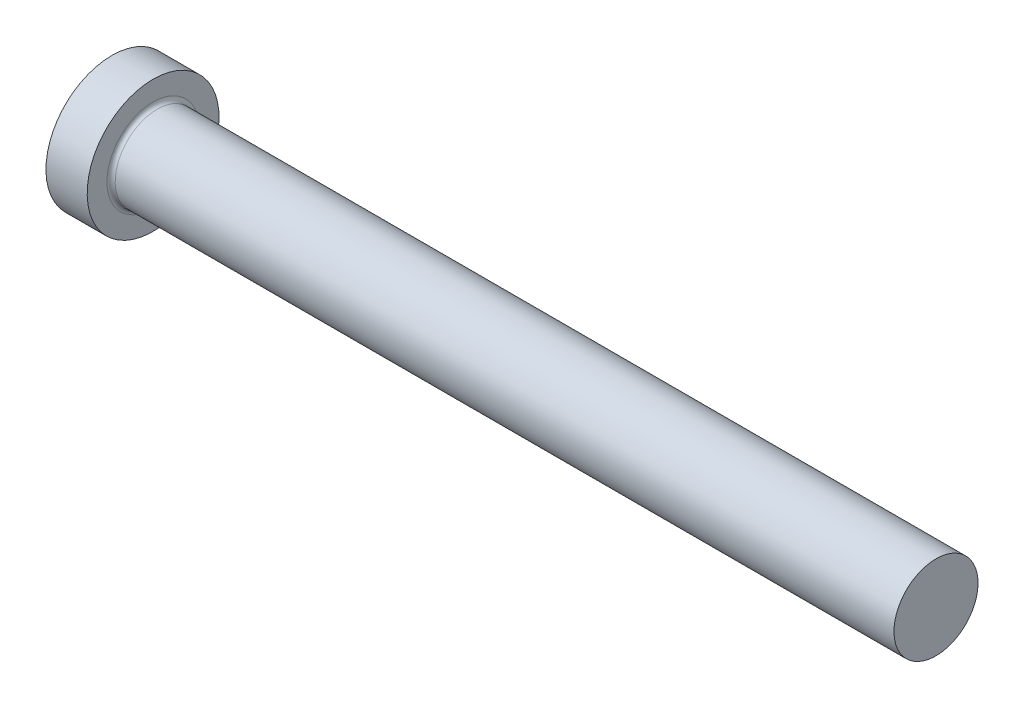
ISO-10303-21;
HEADER;
FILE_DESCRIPTION(('STEP AP214'),'2;1');
FILE_NAME('part.step','',(''),(''),'','','');
FILE_SCHEMA(('AUTOMOTIVE_DESIGN { 1 0 10303 214 1 1 1 1 }'));
ENDSEC;
DATA;
#1=APPLICATION_CONTEXT('core data for automotive mechanical design processes');
#2=APPLICATION_PROTOCOL_DEFINITION('international standard','automotive_design',2000,#1);
#3=PRODUCT_CONTEXT('',#1,'mechanical');
#4=PRODUCT('Part','Part','',(#3));
#5=PRODUCT_RELATED_PRODUCT_CATEGORY('part','',(#4));
#6=PRODUCT_DEFINITION_FORMATION('','',#4);
#7=PRODUCT_DEFINITION_CONTEXT('part definition',#1,'design');
#8=PRODUCT_DEFINITION('design','',#6,#7);
#9=PRODUCT_DEFINITION_SHAPE('','',#8);
#10=(LENGTH_UNIT() NAMED_UNIT(*) SI_UNIT(.MILLI.,.METRE.));
#11=(NAMED_UNIT(*) PLANE_ANGLE_UNIT() SI_UNIT($,.RADIAN.));
#12=(NAMED_UNIT(*) SI_UNIT($,.STERADIAN.) SOLID_ANGLE_UNIT());
#13=UNCERTAINTY_MEASURE_WITH_UNIT(LENGTH_MEASURE(1.E-05),#10,'distance_accuracy_value','');
#14=(GEOMETRIC_REPRESENTATION_CONTEXT(3) GLOBAL_UNCERTAINTY_ASSIGNED_CONTEXT((#13)) GLOBAL_UNIT_ASSIGNED_CONTEXT((#10,
#11,#12)) REPRESENTATION_CONTEXT('',''));
#15=CARTESIAN_POINT('',(0.,0.,0.));
#16=DIRECTION('',(0.,0.,1.));
#17=DIRECTION('',(1.,0.,0.));
#18=AXIS2_PLACEMENT_3D('',#15,#16,#17);
#19=CARTESIAN_POINT('',(0.,0.,0.));
#20=DIRECTION('',(-1.,0.,0.));
#21=DIRECTION('',(0.,-1.,0.));
#22=AXIS2_PLACEMENT_3D('',#19,#20,#21);
#23=PLANE('',#22);
#24=CARTESIAN_POINT('',(0.,0.,0.));
#25=DIRECTION('',(1.,0.,0.));
#26=DIRECTION('',(0.,1.,0.));
#27=AXIS2_PLACEMENT_3D('',#24,#25,#26);
#28=CIRCLE('',#27,8.);
#29=CARTESIAN_POINT('',(0.,8.,0.));
#30=VERTEX_POINT('',#29);
#31=EDGE_CURVE('E24',#30,#30,#28,.T.);
#32=ORIENTED_EDGE('',*,*,#31,.F.);
#33=EDGE_LOOP('',(#32));
#34=FACE_BOUND('',#33,.T.);
#35=ADVANCED_FACE('F13',(#34),#23,.T.);
#36=CARTESIAN_POINT('',(100.,0.,0.));
#37=DIRECTION('',(1.,0.,0.));
#38=DIRECTION('',(0.,1.,0.));
#39=AXIS2_PLACEMENT_3D('',#36,#37,#38);
#40=CYLINDRICAL_SURFACE('',#39,8.);
#41=ORIENTED_EDGE('',*,*,#31,.T.);
#42=EDGE_LOOP('',(#41));
#43=FACE_BOUND('',#42,.T.);
#44=CARTESIAN_POINT('',(5.,0.,0.));
#45=DIRECTION('',(1.,0.,0.));
#46=DIRECTION('',(0.,1.,0.));
#47=AXIS2_PLACEMENT_3D('',#44,#45,#46);
#48=CIRCLE('',#47,8.);
#49=CARTESIAN_POINT('',(5.,8.,0.));
#50=VERTEX_POINT('',#49);
#51=EDGE_CURVE('E28',#50,#50,#48,.T.);
#52=ORIENTED_EDGE('',*,*,#51,.F.);
#53=EDGE_LOOP('',(#52));
#54=FACE_BOUND('',#53,.T.);
#55=ADVANCED_FACE('F50',(#43,#54),#40,.T.);
#56=CARTESIAN_POINT('',(5.,8.,0.));
#57=DIRECTION('',(1.,0.,0.));
#58=DIRECTION('',(0.,1.,0.));
#59=AXIS2_PLACEMENT_3D('',#56,#57,#58);
#60=PLANE('',#59);
#61=CARTESIAN_POINT('',(5.,0.,0.));
#62=DIRECTION('',(1.,0.,0.));
#63=DIRECTION('',(0.,1.,0.));
#64=AXIS2_PLACEMENT_3D('',#61,#62,#63);
#65=CIRCLE('',#64,5.6);
#66=CARTESIAN_POINT('',(5.,5.6,0.));
#67=VERTEX_POINT('',#66);
#68=EDGE_CURVE('E8',#67,#67,#65,.F.);
#69=ORIENTED_EDGE('',*,*,#68,.T.);
#70=EDGE_LOOP('',(#69));
#71=FACE_BOUND('',#70,.T.);
#72=ORIENTED_EDGE('',*,*,#51,.T.);
#73=EDGE_LOOP('',(#72));
#74=FACE_BOUND('',#73,.T.);
#75=ADVANCED_FACE('F41',(#71,#74),#60,.T.);
#76=CARTESIAN_POINT('',(100.,0.,0.));
#77=DIRECTION('',(1.,0.,0.));
#78=DIRECTION('',(0.,1.,0.));
#79=AXIS2_PLACEMENT_3D('',#76,#77,#78);
#80=CYLINDRICAL_SURFACE('',#79,5.1);
#81=CARTESIAN_POINT('',(5.5,0.,0.));
#82=DIRECTION('',(1.,0.,0.));
#83=DIRECTION('',(0.,1.,0.));
#84=AXIS2_PLACEMENT_3D('',#81,#82,#83);
#85=CIRCLE('',#84,5.1);
#86=CARTESIAN_POINT('',(5.5,5.1,0.));
#87=VERTEX_POINT('',#86);
#88=EDGE_CURVE('E20',#87,#87,#85,.T.);
#89=ORIENTED_EDGE('',*,*,#88,.T.);
#90=EDGE_LOOP('',(#89));
#91=FACE_BOUND('',#90,.T.);
#92=CARTESIAN_POINT('',(100.,0.,0.));
#93=DIRECTION('',(1.,0.,0.));
#94=DIRECTION('',(0.,1.,0.));
#95=AXIS2_PLACEMENT_3D('',#92,#93,#94);
#96=CIRCLE('',#95,5.1);
#97=CARTESIAN_POINT('',(100.,5.09999999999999,0.));
#98=VERTEX_POINT('',#97);
#99=EDGE_CURVE('E33',#98,#98,#96,.T.);
#100=ORIENTED_EDGE('',*,*,#99,.F.);
#101=EDGE_LOOP('',(#100));
#102=FACE_BOUND('',#101,.T.);
#103=ADVANCED_FACE('F39',(#91,#102),#80,.T.);
#104=CARTESIAN_POINT('',(100.,5.1,0.));
#105=DIRECTION('',(1.,0.,0.));
#106=DIRECTION('',(0.,1.,0.));
#107=AXIS2_PLACEMENT_3D('',#104,#105,#106);
#108=PLANE('',#107);
#109=ORIENTED_EDGE('',*,*,#99,.T.);
#110=EDGE_LOOP('',(#109));
#111=FACE_BOUND('',#110,.T.);
#112=ADVANCED_FACE('F37',(#111),#108,.T.);
#113=CARTESIAN_POINT('',(5.5,0.,0.));
#114=DIRECTION('',(1.,0.,0.));
#115=DIRECTION('',(0.,1.,0.));
#116=AXIS2_PLACEMENT_3D('',#113,#114,#115);
#117=TOROIDAL_SURFACE('',#116,5.6,0.5);
#118=ORIENTED_EDGE('',*,*,#68,.F.);
#119=EDGE_LOOP('',(#118));
#120=FACE_BOUND('',#119,.T.);
#121=ORIENTED_EDGE('',*,*,#88,.F.);
#122=EDGE_LOOP('',(#121));
#123=FACE_BOUND('',#122,.T.);
#124=ADVANCED_FACE('F15',(#120,#123),#117,.F.);
#125=CLOSED_SHELL('',(#35,#55,#75,#103,#112,#124));
#126=MANIFOLD_SOLID_BREP('B1',#125);
#127=ADVANCED_BREP_SHAPE_REPRESENTATION('',(#18,#126),#14);
#128=SHAPE_DEFINITION_REPRESENTATION(#9,#127);
ENDSEC;
END-ISO-10303-21;
